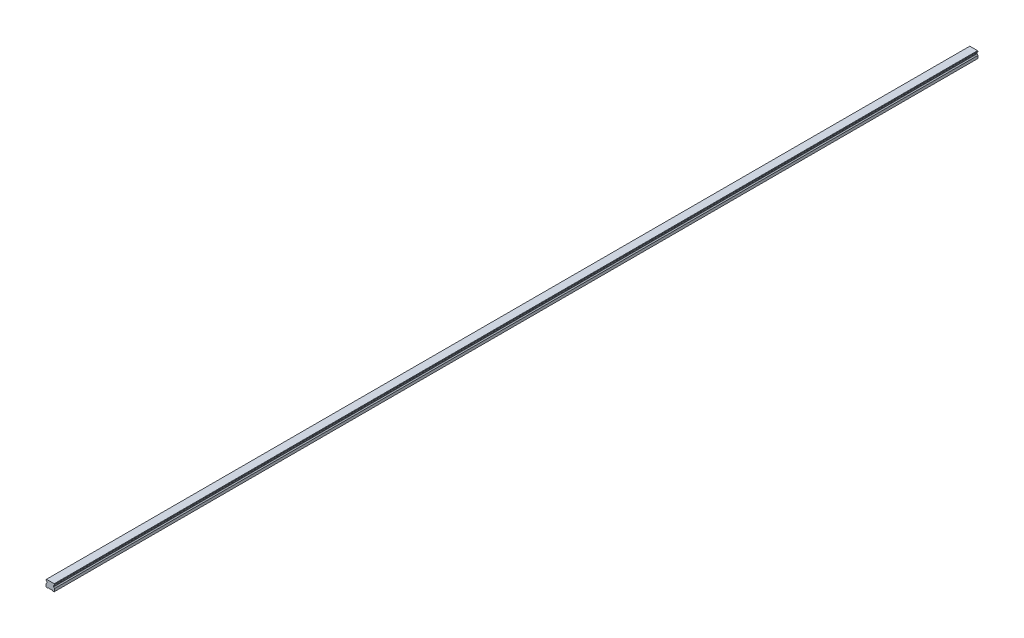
from build123d import *

# Parameters (mm, degrees)
SKETCH1_W           = 20
SKETCH1_H           = 16.3
BOSS_EXTRUDE1_DEPTH = 1070
CUT_EXTRUDE1_DEPTH  = 2141.085439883
CHAMFER1_SIZE       = 1
FILLET1_R           = 1
CUT_EXTRUDE2_DEPTH  = 2141.085439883
SKETCH5_R           = 3
SKETCH5_R_2         = 2.5
CUT_EXTRUDE5_DEPTH  = 10
SKETCH5_2_R         = 2.5
CUT_EXTRUDE6_DEPTH  = 13
LPATTERN2_COUNT     = 36
LPATTERN2_PITCH     = 60


with BuildPart() as part:
    # Sketch1 → Boss-Extrude1 (new, symmetric)
    with BuildSketch(Plane.XY):
        with Locations((0, 8.15)):
            Rectangle(SKETCH1_W, SKETCH1_H)
    extrude(amount=BOSS_EXTRUDE1_DEPTH, both=True)

    # Sketch2 → Cut-Extrude1 (cut, through all)
    with BuildSketch(Plane.XY.offset(1070)):
        Polygon((-10, 14.3), (-10, 7.3), (-7.666666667, 9.633333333), (-7.666666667, 11.966666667), align=None)
        Polygon((7.666666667, 11.966666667), (10, 14.3), (10, 7.3), (7.666666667, 9.633333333), align=None)
    extrude(amount=-CUT_EXTRUDE1_DEPTH, mode=Mode.SUBTRACT)

    # Chamfer1
    chamfer1_edges = [part.edges().sort_by_distance(p)[0] for p in [
        (-10, 16.3, 0),
        (10, 16.3, 0),
        (10, 0, 0),
        (-10, 0, 0),
    ]]
    chamfer(chamfer1_edges, length=CHAMFER1_SIZE)

    # Fillet1
    fillet1_edges = [part.edges().sort_by_distance(p)[0] for p in [
        (-7.666666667, 11.966666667, 0),
        (-7.666666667, 9.633333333, 0),
        (7.666666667, 9.633333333, 0),
        (7.666666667, 11.966666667, 0),
    ]]
    fillet(fillet1_edges, radius=FILLET1_R)

    # Sketch3 → Cut-Extrude2 (cut, through all)
    with BuildSketch(Plane.XY.offset(1070)):
        Polygon((-6, 0), (-5, 1), (5, 1), (6, 0), align=None)
    extrude(amount=-CUT_EXTRUDE2_DEPTH, mode=Mode.SUBTRACT)

    # Sketch5 → Cut-Extrude5 (cut)
    with BuildSketch(Plane.XZ.offset(-1)):
        with Locations(Location((0, 1050, 0), (0, 0, 270))):
            Circle(SKETCH5_R)
        with Locations(Location((0, 1050, 0), (0, 0, 270))):
            Circle(SKETCH5_R_2, mode=Mode.SUBTRACT)
    cut_extrude5 = extrude(amount=-CUT_EXTRUDE5_DEPTH, mode=Mode.SUBTRACT)

    # Sketch5_2 → Cut-Extrude6 (cut)
    with BuildSketch(Plane.XZ.offset(-1)):
        with Locations(Location((0, 1050, 0), (0, 0, 270))):
            Circle(SKETCH5_2_R)
    cut_extrude6 = extrude(amount=-CUT_EXTRUDE6_DEPTH, mode=Mode.SUBTRACT)

    # Cut-Extrude7 cone 1 section (on through the dimple's axis) → Cut-Extrude7 (revolve, cut)
    with BuildSketch(Plane(origin=(0, 14, 1050), x_dir=(0, 0, -1), z_dir=(1, 0, 0))):
        Polygon((0, 0), (2.5, 0), (0, 1.443375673), align=None)
    cut_extrude7 = revolve(axis=Axis((0, 14, 1050), (0, 1, 0)), mode=Mode.SUBTRACT)

    # LPattern2: Cut-Extrude5, Cut-Extrude6, Cut-Extrude7 ×36
    with Locations(*[(0, 0, -i * LPATTERN2_PITCH) for i in range(1, LPATTERN2_COUNT)]):
        add(cut_extrude5, mode=Mode.SUBTRACT)
        add(cut_extrude6, mode=Mode.SUBTRACT)
        add(cut_extrude7, mode=Mode.SUBTRACT)


solid = part.part
